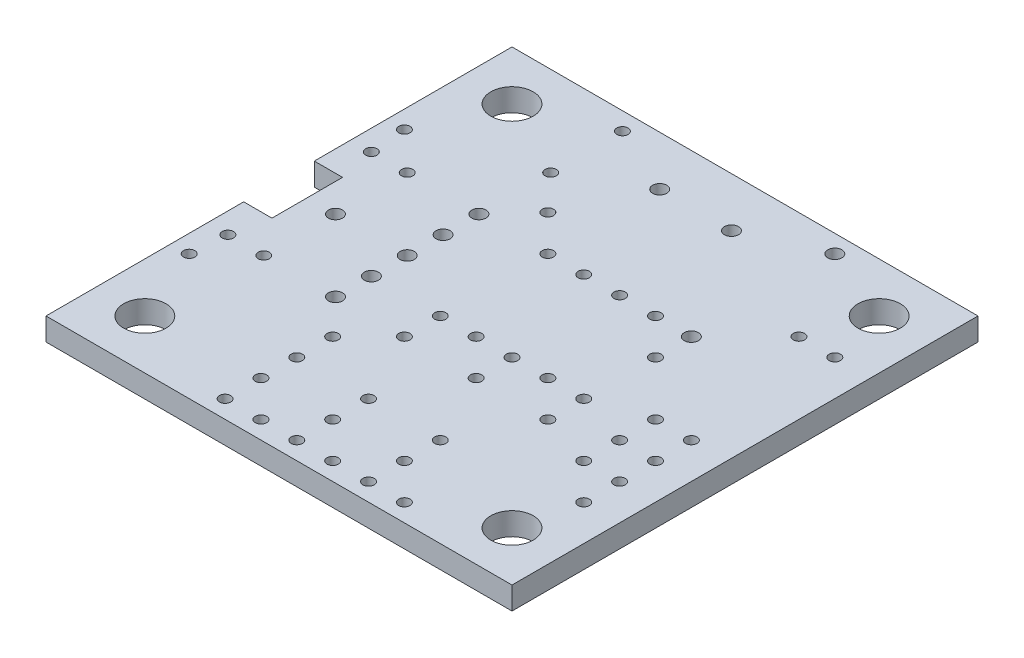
from build123d import *

# Parameters (mm, degrees)
ESQUISSE1_R      = 1.5
ESQUISSE1_R_2    = 0.5
ESQUISSE1_R_3    = 0.4
EXTRUSION1_DEPTH = 1.6


with BuildPart() as part:
    # Esquisse1 → Extrusion1 (new body)
    with BuildSketch(Plane(origin=(0, 0, 0), x_dir=(1, 0, 0), z_dir=(0, 1, 0))):
        Polygon((0, 0), (33, 0), (33, 33), (0, 33), (0, 19), (2, 19), (2, 14), (0, 14), align=None)
        with Locations(Location((3.5, 3.5, 0), (0, 0, 270))):
            Circle(ESQUISSE1_R, mode=Mode.SUBTRACT)
        with Locations(Location((29.5, 3.5, 0), (0, 0, 90))):
            Circle(ESQUISSE1_R, mode=Mode.SUBTRACT)
        with Locations(Location((3.5, 29.5, 0), (0, 0, 90))):
            Circle(ESQUISSE1_R, mode=Mode.SUBTRACT)
        with Locations(Location((29.5, 29.5, 0), (0, 0, 270))):
            Circle(ESQUISSE1_R, mode=Mode.SUBTRACT)
        with Locations(Location((4, 16.5, 0), (0, 0, 270))):
            Circle(ESQUISSE1_R_2, mode=Mode.SUBTRACT)
        with Locations(Location((9.08, 16.5, 0), (0, 0, 270))):
            Circle(ESQUISSE1_R_2, mode=Mode.SUBTRACT)
        with Locations(Location((9.08, 13.96, 0), (0, 0, 270))):
            Circle(ESQUISSE1_R_2, mode=Mode.SUBTRACT)
        with Locations(Location((9.08, 11.42, 0), (0, 0, 270))):
            Circle(ESQUISSE1_R_2, mode=Mode.SUBTRACT)
        with Locations(Location((1.46, 21.58, 0), (0, 0, 90))):
            Circle(ESQUISSE1_R_3, mode=Mode.SUBTRACT)
        with Locations(Location((4, 11.42, 0), (0, 0, 270))):
            Circle(ESQUISSE1_R_3, mode=Mode.SUBTRACT)
        with Locations(Location((1.46, 11.42, 0), (0, 0, 270))):
            Circle(ESQUISSE1_R_3, mode=Mode.SUBTRACT)
        with Locations(Location((16.5, 21.58, 0), (0, 0, 270))):
            Circle(ESQUISSE1_R_3, mode=Mode.SUBTRACT)
        with Locations(Location((4, 21.58, 0), (0, 0, 90))):
            Circle(ESQUISSE1_R_3, mode=Mode.SUBTRACT)
        with Locations(Location((9.08, 21.58, 0), (0, 0, 90))):
            Circle(ESQUISSE1_R_2, mode=Mode.SUBTRACT)
        with Locations(Location((9.08, 19.04, 0), (0, 0, 90))):
            Circle(ESQUISSE1_R_2, mode=Mode.SUBTRACT)
        with Locations(Location((9.08, 26.66, 0), (0, 0, 90))):
            Circle(ESQUISSE1_R_3, mode=Mode.SUBTRACT)
        with Locations(Location((9.08, 31.74, 0), (0, 0, 90))):
            Circle(ESQUISSE1_R_3, mode=Mode.SUBTRACT)
        with Locations(Location((16.5, 3.8, 0), (0, 0, 270))):
            Circle(ESQUISSE1_R_3, mode=Mode.SUBTRACT)
        with Locations(Location((16.5, 6.34, 0), (0, 0, 270))):
            Circle(ESQUISSE1_R_3, mode=Mode.SUBTRACT)
        with Locations(Location((24.12, 11.42, 0), (0, 0, 270))):
            Circle(ESQUISSE1_R_3, mode=Mode.SUBTRACT)
        with Locations(Location((16.5, 1.26, 0), (0, 0, 270))):
            Circle(ESQUISSE1_R_3, mode=Mode.SUBTRACT)
        with Locations(Location((19.04, 11.42, 0), (0, 0, 270))):
            Circle(ESQUISSE1_R_3, mode=Mode.SUBTRACT)
        with Locations(Location((13.96, 11.42, 0), (0, 0, 270))):
            Circle(ESQUISSE1_R_3, mode=Mode.SUBTRACT)
        with Locations(Location((13.96, 1.26, 0), (0, 0, 270))):
            Circle(ESQUISSE1_R_3, mode=Mode.SUBTRACT)
        with Locations(Location((11.42, 3.8, 0), (0, 0, 270))):
            Circle(ESQUISSE1_R_3, mode=Mode.SUBTRACT)
        with Locations(Location((11.42, 6.34, 0), (0, 0, 270))):
            Circle(ESQUISSE1_R_3, mode=Mode.SUBTRACT)
        with Locations(Location((11.42, 1.26, 0), (0, 0, 270))):
            Circle(ESQUISSE1_R_3, mode=Mode.SUBTRACT)
        with Locations(Location((1.26, 8.88, 0), (0, 0, 270))):
            Circle(ESQUISSE1_R_3, mode=Mode.SUBTRACT)
        with Locations(Location((11.42, 24.12, 0), (0, 0, 90))):
            Circle(ESQUISSE1_R_3, mode=Mode.SUBTRACT)
        with Locations(Location((19.04, 1.26, 0), (0, 0, 270))):
            Circle(ESQUISSE1_R_3, mode=Mode.SUBTRACT)
        with Locations(Location((21.58, 3.8, 0), (0, 0, 270))):
            Circle(ESQUISSE1_R_3, mode=Mode.SUBTRACT)
        with Locations(Location((21.58, 6.34, 0), (0, 0, 270))):
            Circle(ESQUISSE1_R_3, mode=Mode.SUBTRACT)
        with Locations(Location((21.58, 1.26, 0), (0, 0, 270))):
            Circle(ESQUISSE1_R_3, mode=Mode.SUBTRACT)
        with Locations(Location((1.26, 24.12, 0), (0, 0, 90))):
            Circle(ESQUISSE1_R_3, mode=Mode.SUBTRACT)
        with Locations(Location((16.5, 13.96, 0), (0, 0, 270))):
            Circle(ESQUISSE1_R_3, mode=Mode.SUBTRACT)
        with Locations(Location((24.12, 1.26, 0), (0, 0, 270))):
            Circle(ESQUISSE1_R_3, mode=Mode.SUBTRACT)
        with Locations(Location((13.96, 13.96, 0), (0, 0, 270))):
            Circle(ESQUISSE1_R_3, mode=Mode.SUBTRACT)
        with Locations(Location((13.96, 21.58, 0), (0, 0, 270))):
            Circle(ESQUISSE1_R_3, mode=Mode.SUBTRACT)
        with Locations(Location((11.42, 8.88, 0), (0, 0, 270))):
            Circle(ESQUISSE1_R_3, mode=Mode.SUBTRACT)
        with Locations(Location((19.04, 21.58, 0), (0, 0, 270))):
            Circle(ESQUISSE1_R_3, mode=Mode.SUBTRACT)
        with Locations(Location((19.04, 13.96, 0), (0, 0, 270))):
            Circle(ESQUISSE1_R_3, mode=Mode.SUBTRACT)
        with Locations(Location((21.58, 21.58, 0), (0, 0, 270))):
            Circle(ESQUISSE1_R_3, mode=Mode.SUBTRACT)
        with Locations(Location((21.58, 13.96, 0), (0, 0, 270))):
            Circle(ESQUISSE1_R_3, mode=Mode.SUBTRACT)
        with Locations(Location((24.12, 21.58, 0), (0, 0, 270))):
            Circle(ESQUISSE1_R_2, mode=Mode.SUBTRACT)
        with Locations(Location((24.12, 31.74, 0), (0, 0, 270))):
            Circle(ESQUISSE1_R_2, mode=Mode.SUBTRACT)
        with Locations(Location((30.47, 15.23, 0), (0, 0, 270))):
            Circle(ESQUISSE1_R_3, mode=Mode.SUBTRACT)
        with Locations(Location((27.93, 15.23, 0), (0, 0, 270))):
            Circle(ESQUISSE1_R_3, mode=Mode.SUBTRACT)
        with Locations(Location((19.04, 29.5, 0), (0, 0, 270))):
            Circle(ESQUISSE1_R_2, mode=Mode.SUBTRACT)
        with Locations(Location((13.96, 29.5, 0), (0, 0, 90))):
            Circle(ESQUISSE1_R_2, mode=Mode.SUBTRACT)
        with Locations(Location((30.47, 12.69, 0), (0, 0, 270))):
            Circle(ESQUISSE1_R_3, mode=Mode.SUBTRACT)
        with Locations(Location((27.93, 12.69, 0), (0, 0, 270))):
            Circle(ESQUISSE1_R_3, mode=Mode.SUBTRACT)
        with Locations(Location((30.47, 10.15, 0), (0, 0, 270))):
            Circle(ESQUISSE1_R_3, mode=Mode.SUBTRACT)
        with Locations(Location((27.93, 10.15, 0), (0, 0, 270))):
            Circle(ESQUISSE1_R_3, mode=Mode.SUBTRACT)
        with Locations(Location((30.47, 25.39, 0), (0, 0, 270))):
            Circle(ESQUISSE1_R_3, mode=Mode.SUBTRACT)
        with Locations(Location((27.93, 25.39, 0), (0, 0, 270))):
            Circle(ESQUISSE1_R_3, mode=Mode.SUBTRACT)
        with Locations(Location((24.12, 19.04, 0), (0, 0, 270))):
            Circle(ESQUISSE1_R_3, mode=Mode.SUBTRACT)
        with Locations(Location((24.12, 13.96, 0), (0, 0, 270))):
            Circle(ESQUISSE1_R_3, mode=Mode.SUBTRACT)
        with Locations(Location((30.47, 7.61, 0), (0, 0, 270))):
            Circle(ESQUISSE1_R_3, mode=Mode.SUBTRACT)
    extrude(amount=EXTRUSION1_DEPTH)


solid = part.part
